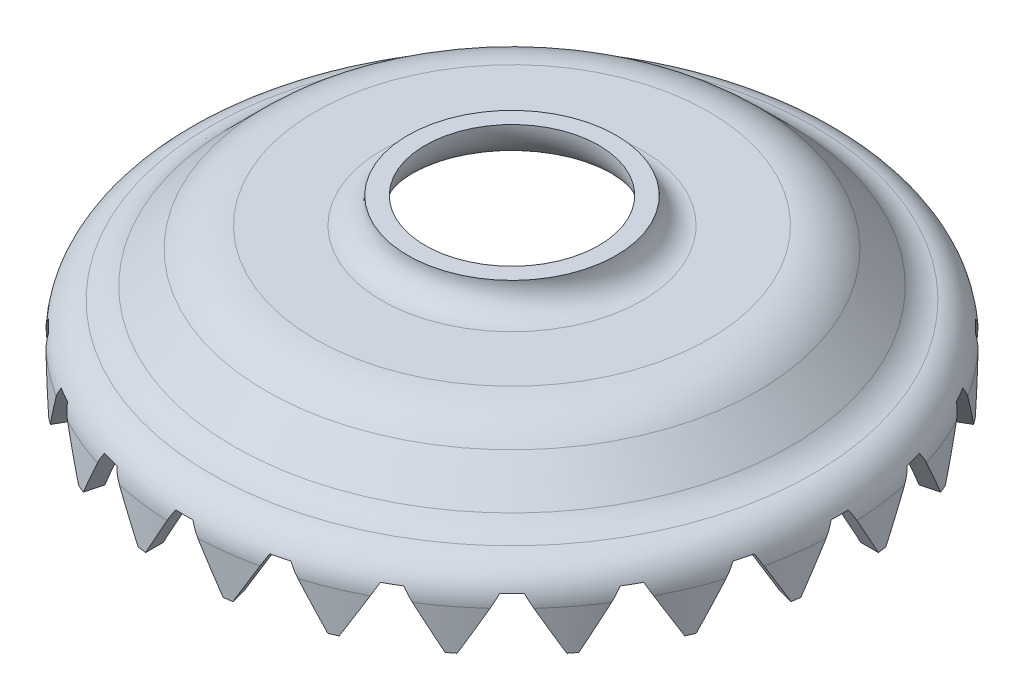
from build123d import *

# Parameters (mm, degrees)
ENL_V_MAT_EXTRU_1_DEPTH      = 58
R_P_TITION_CIRCULAIRE1_COUNT = 24
R_P_TITION_CIRCULAIRE1_ANGLE = 345


with BuildPart() as part:
    # Esquisse1 → Base-R_volution (revolve)
    with BuildSketch(Plane.XY, mode=Mode.PRIVATE) as base_r_volution_sk:
        with BuildLine():
            Line((-12, 19), (-10, 19))
            ThreePointArc((-10, 19), (-11.464466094, 15.464466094), (-15, 14))
            Line((-15, 14), (-22.686291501, 14))
            ThreePointArc((-22.686291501, 14), (-24.982392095, 13.543277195), (-26.928932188, 12.242640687))
            Line((-26.928932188, 12.242640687), (-30.621320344, 8.550252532))
            ThreePointArc((-30.621320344, 8.550252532), (-32.335943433, 7.292426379), (-34.34912618, 6.607478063))
            ThreePointArc((-34.34912618, 6.607478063), (-35.532685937, 5.923049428), (-36, 4.638186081))
            Line((-36, 4.638186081), (-36, 0))
            Line((-36, 0), (-38, 0))
            Line((-38, 0), (-38, 4.638186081))
            ThreePointArc((-38, 4.638186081), (-37.065371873, 7.207912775), (-34.698252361, 8.576770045))
            ThreePointArc((-34.698252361, 8.576770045), (-33.260264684, 9.066018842), (-32.035533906, 9.964466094))
            Line((-32.035533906, 9.964466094), (-28.343145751, 13.656854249))
            ThreePointArc((-28.343145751, 13.656854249), (-25.74775896, 15.39103626), (-22.686291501, 16))
            Line((-22.686291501, 16), (-15, 16))
            ThreePointArc((-15, 16), (-12.878679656, 16.878679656), (-12, 19))
        make_face()
    revolve(base_r_volution_sk.sketch.rotate(Axis((0, 0, 0), (0, 1, 0)), 270), axis=Axis((0, 0, 0), (0, 1, 0)))

    # Esquisse2 → Enl_v. mat.-Extru.1 (cut, through all)
    with BuildSketch(Plane.XY):
        Polygon((-1, 6), (1, 6), (5.041451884, -1), (-5.041451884, -1), align=None)
    enl_v_mat_extru_1 = extrude(amount=-ENL_V_MAT_EXTRU_1_DEPTH, mode=Mode.SUBTRACT)

    # R_p_tition circulaire1: Enl_v. mat.-Extru.1 ×24 about axis
    r_p_tition_circulaire1_axis = Axis((0, 0, 0), (0, 1, 0))
    for i in range(1, R_P_TITION_CIRCULAIRE1_COUNT):
        add(enl_v_mat_extru_1.rotate(r_p_tition_circulaire1_axis, i * R_P_TITION_CIRCULAIRE1_ANGLE / (R_P_TITION_CIRCULAIRE1_COUNT - 1)), mode=Mode.SUBTRACT)


solid = part.part
